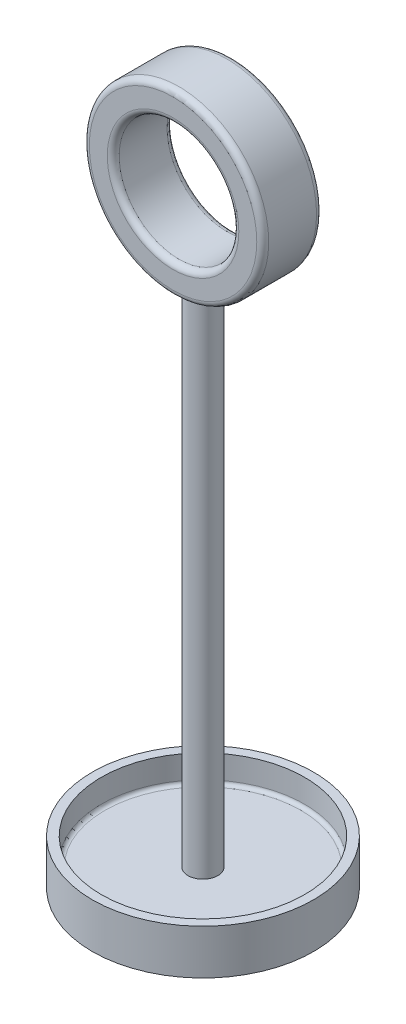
from build123d import *

# Parameters (mm, degrees)
SKETCH1_R          = 38.1
EXTRUDE1_DEPTH     = 12.7
SKETCH3_R          = 6.35
EXTRUDE2_DEPTH     = 254
SKETCH5_R          = 25.4
CUT_EXTRUDE1_DEPTH = 273.426101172
FILLET1_R          = 2.54
FILLET2_R          = 2.54
FILLET3_R          = 1.524
SKETCH6_R          = 6.35
CUT_EXTRUDE2_DEPTH = 300.563900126
SKETCH7_R          = 6.35
EXTRUDE3_DEPTH     = 7.62
SKETCH8_R          = 12.7
EXTRUDE4_DEPTH     = 6.35


with BuildPart() as part:
    # Sketch1 → Extrude1 (new, symmetric)
    with BuildSketch(Plane.XY):
        Circle(SKETCH1_R)
    extrude(amount=EXTRUDE1_DEPTH, both=True)

    # Sketch3 → Extrude2 (add)
    with BuildSketch(Plane(origin=(0, 0, 0), x_dir=(1, 0, 0), z_dir=(0, 1, 0))):
        with Locations(Location((0, 0, 0), (0, 0, 270))):
            Circle(SKETCH3_R)
    extrude(amount=-EXTRUDE2_DEPTH)

    # Sketch5 → Cut-Extrude1 (cut, through all)
    with BuildSketch(Plane.XY.offset(12.7)):
        Circle(SKETCH5_R)
    extrude(amount=-CUT_EXTRUDE1_DEPTH, mode=Mode.SUBTRACT)

    # Fillet1
    fillet1_edges = [part.edges().sort_by_distance(p)[0] for p in [
        (-25.4, 0, -12.7),
        (-25.4, 0, 12.7),
        (-38.1, 0, -12.7),
        (-38.1, 0, 12.7),
    ]]
    fillet(fillet1_edges, radius=FILLET1_R)

    # Fillet2
    fillet2_edges = [part.edges().sort_by_distance(p)[0] for p in [
        (0, -38.1, -6.349999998),
    ]]
    fillet(fillet2_edges, radius=FILLET2_R)


with BuildPart() as body_2:
    # Sketch4 → Revolve1 (revolve)
    with BuildSketch(Plane(origin=(0, 0, 0), x_dir=(0, 0, -1), z_dir=(1, 0, 0))):
        Polygon((-43.18, -242.57), (-43.18, -254), (0, -254), (0, -261.62), (-46.99, -261.62), (-46.99, -242.57), align=None)
    revolve(axis=Axis((0, -177.235139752, 0), (0, -1, 0)))

    # Fillet3
    fillet3_edges = [body_2.edges().sort_by_distance(p)[0] for p in [
        (0, -254, -43.18),
    ]]
    fillet(fillet3_edges, radius=FILLET3_R)

    # Sketch6 → Cut-Extrude2 (cut, through all)
    with BuildSketch(Plane(origin=(0, -254, 0), x_dir=(1, 0, 0), z_dir=(0, 1, 0))):
        with Locations(Location((0, 0, 0), (0, 0, 270))):
            Circle(SKETCH6_R)
    extrude(amount=-CUT_EXTRUDE2_DEPTH, mode=Mode.SUBTRACT)


with BuildPart() as body_3:
    # Sketch7 → Extrude3 (new body)
    with BuildSketch(Plane.XZ.offset(254)):
        with Locations(Location((0, 0, 0), (0, 0, 90))):
            Circle(SKETCH7_R)
    extrude(amount=EXTRUDE3_DEPTH)


with BuildPart() as body_4:
    # Sketch8 → Extrude4 (new body)
    with BuildSketch(Plane.XZ.offset(261.62)):
        with Locations(Location((0, 0, 0), (0, 0, 270))):
            Circle(SKETCH8_R)
    extrude(amount=EXTRUDE4_DEPTH)


with BuildPart() as body_3_1:
    add(body_3.part)

    # Combine1: union body 4, part
    add(body_4.part)
    add(part.part)


solid = Compound([body_2.part, body_3_1.part])
